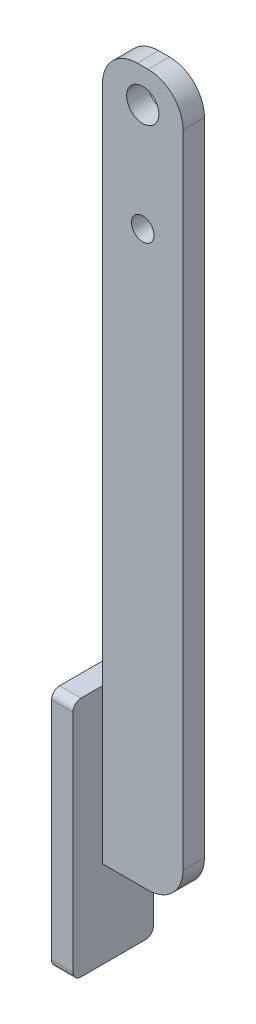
ISO-10303-21;
HEADER;
FILE_DESCRIPTION(('STEP AP214'),'2;1');
FILE_NAME('part.step','',(''),(''),'','','');
FILE_SCHEMA(('AUTOMOTIVE_DESIGN { 1 0 10303 214 1 1 1 1 }'));
ENDSEC;
DATA;
#1=APPLICATION_CONTEXT('core data for automotive mechanical design processes');
#2=APPLICATION_PROTOCOL_DEFINITION('international standard','automotive_design',2000,#1);
#3=PRODUCT_CONTEXT('',#1,'mechanical');
#4=PRODUCT('Part','Part','',(#3));
#5=PRODUCT_RELATED_PRODUCT_CATEGORY('part','',(#4));
#6=PRODUCT_DEFINITION_FORMATION('','',#4);
#7=PRODUCT_DEFINITION_CONTEXT('part definition',#1,'design');
#8=PRODUCT_DEFINITION('design','',#6,#7);
#9=PRODUCT_DEFINITION_SHAPE('','',#8);
#10=(LENGTH_UNIT() NAMED_UNIT(*) SI_UNIT(.MILLI.,.METRE.));
#11=(NAMED_UNIT(*) PLANE_ANGLE_UNIT() SI_UNIT($,.RADIAN.));
#12=(NAMED_UNIT(*) SI_UNIT($,.STERADIAN.) SOLID_ANGLE_UNIT());
#13=UNCERTAINTY_MEASURE_WITH_UNIT(LENGTH_MEASURE(1.E-05),#10,'distance_accuracy_value','');
#14=(GEOMETRIC_REPRESENTATION_CONTEXT(3) GLOBAL_UNCERTAINTY_ASSIGNED_CONTEXT((#13)) GLOBAL_UNIT_ASSIGNED_CONTEXT((#10,
#11,#12)) REPRESENTATION_CONTEXT('',''));
#15=CARTESIAN_POINT('',(0.,0.,0.));
#16=DIRECTION('',(0.,0.,1.));
#17=DIRECTION('',(1.,0.,0.));
#18=AXIS2_PLACEMENT_3D('',#15,#16,#17);
#19=CARTESIAN_POINT('',(0.,0.,4.));
#20=DIRECTION('',(0.,0.,-1.));
#21=DIRECTION('',(-1.,0.,0.));
#22=AXIS2_PLACEMENT_3D('',#19,#20,#21);
#23=PLANE('',#22);
#24=DIRECTION('',(1.,0.,0.));
#25=VECTOR('',#24,1.);
#26=CARTESIAN_POINT('',(-15.,-252.5,4.));
#27=LINE('',#26,#25);
#28=CARTESIAN_POINT('',(-15.,-252.5,4.));
#29=VERTEX_POINT('',#28);
#30=CARTESIAN_POINT('',(2.00000000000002,-252.5,4.));
#31=VERTEX_POINT('',#30);
#32=EDGE_CURVE('E218',#29,#31,#27,.T.);
#33=ORIENTED_EDGE('',*,*,#32,.T.);
#34=CARTESIAN_POINT('',(2.00000000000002,-239.5,4.));
#35=DIRECTION('',(0.,0.,-1.));
#36=DIRECTION('',(-1.,0.,0.));
#37=AXIS2_PLACEMENT_3D('',#34,#35,#36);
#38=CIRCLE('',#37,13.);
#39=CARTESIAN_POINT('',(15.,-239.5,4.));
#40=VERTEX_POINT('',#39);
#41=EDGE_CURVE('E12',#31,#40,#38,.F.);
#42=ORIENTED_EDGE('',*,*,#41,.T.);
#43=DIRECTION('',(0.,-1.,0.));
#44=VECTOR('',#43,1.);
#45=CARTESIAN_POINT('',(15.,12.5,4.));
#46=LINE('',#45,#44);
#47=CARTESIAN_POINT('',(15.,-0.499999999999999,4.));
#48=VERTEX_POINT('',#47);
#49=EDGE_CURVE('E219',#48,#40,#46,.T.);
#50=ORIENTED_EDGE('',*,*,#49,.F.);
#51=CARTESIAN_POINT('',(2.,-0.5,4.));
#52=DIRECTION('',(0.,0.,-1.));
#53=DIRECTION('',(-1.,0.,0.));
#54=AXIS2_PLACEMENT_3D('',#51,#52,#53);
#55=CIRCLE('',#54,13.);
#56=CARTESIAN_POINT('',(2.,12.5,4.));
#57=VERTEX_POINT('',#56);
#58=EDGE_CURVE('E240',#48,#57,#55,.F.);
#59=ORIENTED_EDGE('',*,*,#58,.T.);
#60=DIRECTION('',(1.,0.,0.));
#61=VECTOR('',#60,1.);
#62=CARTESIAN_POINT('',(-15.,12.5,4.));
#63=LINE('',#62,#61);
#64=CARTESIAN_POINT('',(-2.,12.5,4.));
#65=VERTEX_POINT('',#64);
#66=EDGE_CURVE('E295',#65,#57,#63,.T.);
#67=ORIENTED_EDGE('',*,*,#66,.F.);
#68=CARTESIAN_POINT('',(-2.,-0.5,4.));
#69=DIRECTION('',(0.,0.,-1.));
#70=DIRECTION('',(-1.,0.,0.));
#71=AXIS2_PLACEMENT_3D('',#68,#69,#70);
#72=CIRCLE('',#71,13.);
#73=CARTESIAN_POINT('',(-15.,-0.500000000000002,4.));
#74=VERTEX_POINT('',#73);
#75=EDGE_CURVE('E238',#65,#74,#72,.F.);
#76=ORIENTED_EDGE('',*,*,#75,.T.);
#77=DIRECTION('',(0.,-1.,0.));
#78=VECTOR('',#77,1.);
#79=CARTESIAN_POINT('',(-15.,12.5,4.));
#80=LINE('',#79,#78);
#81=CARTESIAN_POINT('',(-15.,-195.,4.));
#82=VERTEX_POINT('',#81);
#83=EDGE_CURVE('E227',#74,#82,#80,.T.);
#84=ORIENTED_EDGE('',*,*,#83,.T.);
#85=EDGE_CURVE('E294',#82,#29,#80,.T.);
#86=ORIENTED_EDGE('',*,*,#85,.T.);
#87=EDGE_LOOP('',(#33,#42,#50,#59,#67,#76,#84,#86));
#88=FACE_BOUND('',#87,.T.);
#89=CARTESIAN_POINT('',(0.,-40.,4.));
#90=DIRECTION('',(0.,0.,1.));
#91=DIRECTION('',(1.,0.,0.));
#92=AXIS2_PLACEMENT_3D('',#89,#90,#91);
#93=CIRCLE('',#92,4.2);
#94=CARTESIAN_POINT('',(4.2,-40.,4.));
#95=VERTEX_POINT('',#94);
#96=EDGE_CURVE('E290',#95,#95,#93,.T.);
#97=ORIENTED_EDGE('',*,*,#96,.F.);
#98=EDGE_LOOP('',(#97));
#99=FACE_BOUND('',#98,.T.);
#100=CARTESIAN_POINT('',(0.,0.,4.));
#101=DIRECTION('',(0.,0.,1.));
#102=DIRECTION('',(1.,0.,0.));
#103=AXIS2_PLACEMENT_3D('',#100,#101,#102);
#104=CIRCLE('',#103,6.00000000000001);
#105=CARTESIAN_POINT('',(6.00000000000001,0.,4.));
#106=VERTEX_POINT('',#105);
#107=EDGE_CURVE('E302',#106,#106,#104,.T.);
#108=ORIENTED_EDGE('',*,*,#107,.F.);
#109=EDGE_LOOP('',(#108));
#110=FACE_BOUND('',#109,.T.);
#111=ADVANCED_FACE('F69',(#88,#99,#110),#23,.F.);
#112=CARTESIAN_POINT('',(0.,0.,-4.));
#113=DIRECTION('',(0.,0.,-1.));
#114=DIRECTION('',(-1.,0.,0.));
#115=AXIS2_PLACEMENT_3D('',#112,#113,#114);
#116=PLANE('',#115);
#117=CARTESIAN_POINT('',(0.,-40.,-4.));
#118=DIRECTION('',(0.,0.,1.));
#119=DIRECTION('',(1.,0.,0.));
#120=AXIS2_PLACEMENT_3D('',#117,#118,#119);
#121=CIRCLE('',#120,4.2);
#122=CARTESIAN_POINT('',(4.2,-40.,-4.));
#123=VERTEX_POINT('',#122);
#124=EDGE_CURVE('E299',#123,#123,#121,.T.);
#125=ORIENTED_EDGE('',*,*,#124,.T.);
#126=EDGE_LOOP('',(#125));
#127=FACE_BOUND('',#126,.T.);
#128=DIRECTION('',(0.,-1.,0.));
#129=VECTOR('',#128,1.);
#130=CARTESIAN_POINT('',(15.,12.5,-4.));
#131=LINE('',#130,#129);
#132=CARTESIAN_POINT('',(15.,-0.499999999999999,-4.));
#133=VERTEX_POINT('',#132);
#134=CARTESIAN_POINT('',(15.,-239.5,-4.));
#135=VERTEX_POINT('',#134);
#136=EDGE_CURVE('E284',#133,#135,#131,.T.);
#137=ORIENTED_EDGE('',*,*,#136,.T.);
#138=CARTESIAN_POINT('',(2.00000000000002,-239.5,-4.));
#139=DIRECTION('',(0.,0.,-1.));
#140=DIRECTION('',(-1.,0.,0.));
#141=AXIS2_PLACEMENT_3D('',#138,#139,#140);
#142=CIRCLE('',#141,13.);
#143=CARTESIAN_POINT('',(2.00000000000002,-252.5,-4.));
#144=VERTEX_POINT('',#143);
#145=EDGE_CURVE('E91',#135,#144,#142,.T.);
#146=ORIENTED_EDGE('',*,*,#145,.T.);
#147=DIRECTION('',(1.,0.,0.));
#148=VECTOR('',#147,1.);
#149=CARTESIAN_POINT('',(-15.,-252.5,-4.));
#150=LINE('',#149,#148);
#151=CARTESIAN_POINT('',(-15.,-252.5,-4.));
#152=VERTEX_POINT('',#151);
#153=EDGE_CURVE('E212',#152,#144,#150,.T.);
#154=ORIENTED_EDGE('',*,*,#153,.F.);
#155=DIRECTION('',(0.,-1.,0.));
#156=VECTOR('',#155,1.);
#157=CARTESIAN_POINT('',(-15.,12.5,-4.));
#158=LINE('',#157,#156);
#159=CARTESIAN_POINT('',(-15.,-195.,-4.));
#160=VERTEX_POINT('',#159);
#161=EDGE_CURVE('E186',#160,#152,#158,.T.);
#162=ORIENTED_EDGE('',*,*,#161,.F.);
#163=CARTESIAN_POINT('',(-15.,-0.500000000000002,-4.));
#164=VERTEX_POINT('',#163);
#165=EDGE_CURVE('E211',#164,#160,#158,.T.);
#166=ORIENTED_EDGE('',*,*,#165,.F.);
#167=CARTESIAN_POINT('',(-2.,-0.5,-4.));
#168=DIRECTION('',(0.,0.,-1.));
#169=DIRECTION('',(-1.,0.,0.));
#170=AXIS2_PLACEMENT_3D('',#167,#168,#169);
#171=CIRCLE('',#170,13.);
#172=CARTESIAN_POINT('',(-2.,12.5,-4.));
#173=VERTEX_POINT('',#172);
#174=EDGE_CURVE('E232',#164,#173,#171,.T.);
#175=ORIENTED_EDGE('',*,*,#174,.T.);
#176=DIRECTION('',(1.,0.,0.));
#177=VECTOR('',#176,1.);
#178=CARTESIAN_POINT('',(-15.,12.5,-4.));
#179=LINE('',#178,#177);
#180=CARTESIAN_POINT('',(2.,12.5,-4.));
#181=VERTEX_POINT('',#180);
#182=EDGE_CURVE('E213',#173,#181,#179,.T.);
#183=ORIENTED_EDGE('',*,*,#182,.T.);
#184=CARTESIAN_POINT('',(2.,-0.5,-4.));
#185=DIRECTION('',(0.,0.,-1.));
#186=DIRECTION('',(-1.,0.,0.));
#187=AXIS2_PLACEMENT_3D('',#184,#185,#186);
#188=CIRCLE('',#187,13.);
#189=EDGE_CURVE('E234',#181,#133,#188,.T.);
#190=ORIENTED_EDGE('',*,*,#189,.T.);
#191=EDGE_LOOP('',(#137,#146,#154,#162,#166,#175,#183,#190));
#192=FACE_BOUND('',#191,.T.);
#193=CARTESIAN_POINT('',(0.,0.,-4.));
#194=DIRECTION('',(0.,0.,1.));
#195=DIRECTION('',(1.,0.,0.));
#196=AXIS2_PLACEMENT_3D('',#193,#194,#195);
#197=CIRCLE('',#196,6.00000000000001);
#198=CARTESIAN_POINT('',(6.00000000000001,0.,-4.));
#199=VERTEX_POINT('',#198);
#200=EDGE_CURVE('E305',#199,#199,#197,.T.);
#201=ORIENTED_EDGE('',*,*,#200,.T.);
#202=EDGE_LOOP('',(#201));
#203=FACE_BOUND('',#202,.T.);
#204=ADVANCED_FACE('F209',(#127,#192,#203),#116,.T.);
#205=CARTESIAN_POINT('',(-15.,-252.5,4.));
#206=DIRECTION('',(0.,1.,0.));
#207=DIRECTION('',(0.,0.,1.));
#208=AXIS2_PLACEMENT_3D('',#205,#206,#207);
#209=PLANE('',#208);
#210=ORIENTED_EDGE('',*,*,#153,.T.);
#211=DIRECTION('',(0.,0.,-1.));
#212=VECTOR('',#211,1.);
#213=CARTESIAN_POINT('',(2.00000000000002,-252.5,4.));
#214=LINE('',#213,#212);
#215=EDGE_CURVE('E77',#144,#31,#214,.F.);
#216=ORIENTED_EDGE('',*,*,#215,.T.);
#217=ORIENTED_EDGE('',*,*,#32,.F.);
#218=DIRECTION('',(0.,0.,-1.));
#219=VECTOR('',#218,1.);
#220=CARTESIAN_POINT('',(-15.,-252.5,4.));
#221=LINE('',#220,#219);
#222=EDGE_CURVE('E224',#29,#152,#221,.T.);
#223=ORIENTED_EDGE('',*,*,#222,.T.);
#224=EDGE_LOOP('',(#210,#216,#217,#223));
#225=FACE_BOUND('',#224,.T.);
#226=ADVANCED_FACE('F341',(#225),#209,.F.);
#227=CARTESIAN_POINT('',(15.,12.5,4.));
#228=DIRECTION('',(1.,0.,0.));
#229=DIRECTION('',(0.,1.,0.));
#230=AXIS2_PLACEMENT_3D('',#227,#228,#229);
#231=PLANE('',#230);
#232=ORIENTED_EDGE('',*,*,#49,.T.);
#233=DIRECTION('',(0.,0.,-1.));
#234=VECTOR('',#233,1.);
#235=CARTESIAN_POINT('',(15.,-239.5,-4.));
#236=LINE('',#235,#234);
#237=EDGE_CURVE('E276',#40,#135,#236,.T.);
#238=ORIENTED_EDGE('',*,*,#237,.T.);
#239=ORIENTED_EDGE('',*,*,#136,.F.);
#240=DIRECTION('',(0.,0.,-1.));
#241=VECTOR('',#240,1.);
#242=CARTESIAN_POINT('',(15.,-0.499999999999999,4.));
#243=LINE('',#242,#241);
#244=EDGE_CURVE('E236',#133,#48,#243,.F.);
#245=ORIENTED_EDGE('',*,*,#244,.T.);
#246=EDGE_LOOP('',(#232,#238,#239,#245));
#247=FACE_BOUND('',#246,.T.);
#248=ADVANCED_FACE('F283',(#247),#231,.T.);
#249=CARTESIAN_POINT('',(-15.,12.5,4.));
#250=DIRECTION('',(0.,1.,0.));
#251=DIRECTION('',(0.,0.,1.));
#252=AXIS2_PLACEMENT_3D('',#249,#250,#251);
#253=PLANE('',#252);
#254=ORIENTED_EDGE('',*,*,#66,.T.);
#255=DIRECTION('',(0.,0.,-1.));
#256=VECTOR('',#255,1.);
#257=CARTESIAN_POINT('',(2.,12.5,4.));
#258=LINE('',#257,#256);
#259=EDGE_CURVE('E229',#57,#181,#258,.T.);
#260=ORIENTED_EDGE('',*,*,#259,.T.);
#261=ORIENTED_EDGE('',*,*,#182,.F.);
#262=DIRECTION('',(0.,0.,-1.));
#263=VECTOR('',#262,1.);
#264=CARTESIAN_POINT('',(-2.,12.5,4.));
#265=LINE('',#264,#263);
#266=EDGE_CURVE('E226',#173,#65,#265,.F.);
#267=ORIENTED_EDGE('',*,*,#266,.T.);
#268=EDGE_LOOP('',(#254,#260,#261,#267));
#269=FACE_BOUND('',#268,.T.);
#270=ADVANCED_FACE('F349',(#269),#253,.T.);
#271=CARTESIAN_POINT('',(-15.,12.5,4.));
#272=DIRECTION('',(1.,0.,0.));
#273=DIRECTION('',(0.,1.,0.));
#274=AXIS2_PLACEMENT_3D('',#271,#272,#273);
#275=PLANE('',#274);
#276=ORIENTED_EDGE('',*,*,#165,.T.);
#277=DIRECTION('',(0.,0.,1.));
#278=VECTOR('',#277,1.);
#279=CARTESIAN_POINT('',(-15.,-195.,4.));
#280=LINE('',#279,#278);
#281=EDGE_CURVE('E196',#160,#82,#280,.T.);
#282=ORIENTED_EDGE('',*,*,#281,.T.);
#283=ORIENTED_EDGE('',*,*,#83,.F.);
#284=DIRECTION('',(0.,0.,-1.));
#285=VECTOR('',#284,1.);
#286=CARTESIAN_POINT('',(-15.,-0.500000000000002,-4.));
#287=LINE('',#286,#285);
#288=EDGE_CURVE('E206',#74,#164,#287,.T.);
#289=ORIENTED_EDGE('',*,*,#288,.T.);
#290=EDGE_LOOP('',(#276,#282,#283,#289));
#291=FACE_BOUND('',#290,.T.);
#292=ADVANCED_FACE('F216',(#291),#275,.F.);
#293=CARTESIAN_POINT('',(0.,-40.,4.));
#294=DIRECTION('',(0.,0.,-1.));
#295=DIRECTION('',(-1.,0.,0.));
#296=AXIS2_PLACEMENT_3D('',#293,#294,#295);
#297=CYLINDRICAL_SURFACE('',#296,4.2);
#298=ORIENTED_EDGE('',*,*,#96,.T.);
#299=EDGE_LOOP('',(#298));
#300=FACE_BOUND('',#299,.T.);
#301=ORIENTED_EDGE('',*,*,#124,.F.);
#302=EDGE_LOOP('',(#301));
#303=FACE_BOUND('',#302,.T.);
#304=ADVANCED_FACE('F374',(#300,#303),#297,.F.);
#305=CARTESIAN_POINT('',(0.,0.,4.));
#306=DIRECTION('',(0.,0.,-1.));
#307=DIRECTION('',(-1.,0.,0.));
#308=AXIS2_PLACEMENT_3D('',#305,#306,#307);
#309=CYLINDRICAL_SURFACE('',#308,6.00000000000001);
#310=ORIENTED_EDGE('',*,*,#107,.T.);
#311=EDGE_LOOP('',(#310));
#312=FACE_BOUND('',#311,.T.);
#313=ORIENTED_EDGE('',*,*,#200,.F.);
#314=EDGE_LOOP('',(#313));
#315=FACE_BOUND('',#314,.T.);
#316=ADVANCED_FACE('F362',(#312,#315),#309,.F.);
#317=CARTESIAN_POINT('',(2.,-0.5,4.));
#318=DIRECTION('',(0.,0.,-1.));
#319=DIRECTION('',(-1.,0.,0.));
#320=AXIS2_PLACEMENT_3D('',#317,#318,#319);
#321=CYLINDRICAL_SURFACE('',#320,13.);
#322=ORIENTED_EDGE('',*,*,#58,.F.);
#323=ORIENTED_EDGE('',*,*,#244,.F.);
#324=ORIENTED_EDGE('',*,*,#189,.F.);
#325=ORIENTED_EDGE('',*,*,#259,.F.);
#326=EDGE_LOOP('',(#322,#323,#324,#325));
#327=FACE_BOUND('',#326,.T.);
#328=ADVANCED_FACE('F346',(#327),#321,.T.);
#329=CARTESIAN_POINT('',(-2.,-0.5,4.));
#330=DIRECTION('',(0.,0.,1.));
#331=DIRECTION('',(1.,0.,0.));
#332=AXIS2_PLACEMENT_3D('',#329,#330,#331);
#333=CYLINDRICAL_SURFACE('',#332,13.);
#334=ORIENTED_EDGE('',*,*,#75,.F.);
#335=ORIENTED_EDGE('',*,*,#266,.F.);
#336=ORIENTED_EDGE('',*,*,#174,.F.);
#337=ORIENTED_EDGE('',*,*,#288,.F.);
#338=EDGE_LOOP('',(#334,#335,#336,#337));
#339=FACE_BOUND('',#338,.T.);
#340=ADVANCED_FACE('F353',(#339),#333,.T.);
#341=CARTESIAN_POINT('',(-15.,0.,0.));
#342=DIRECTION('',(1.,0.,0.));
#343=DIRECTION('',(0.,1.,0.));
#344=AXIS2_PLACEMENT_3D('',#341,#342,#343);
#345=PLANE('',#344);
#346=DIRECTION('',(0.,0.,1.));
#347=VECTOR('',#346,1.);
#348=CARTESIAN_POINT('',(-15.,-285.,-15.));
#349=LINE('',#348,#347);
#350=CARTESIAN_POINT('',(-15.,-285.,-12.));
#351=VERTEX_POINT('',#350);
#352=CARTESIAN_POINT('',(-15.,-285.,12.));
#353=VERTEX_POINT('',#352);
#354=EDGE_CURVE('E315',#351,#353,#349,.T.);
#355=ORIENTED_EDGE('',*,*,#354,.F.);
#356=CARTESIAN_POINT('',(-15.,-282.,-12.));
#357=DIRECTION('',(1.,0.,0.));
#358=DIRECTION('',(0.,1.,0.));
#359=AXIS2_PLACEMENT_3D('',#356,#357,#358);
#360=CIRCLE('',#359,3.);
#361=CARTESIAN_POINT('',(-15.,-282.,-15.));
#362=VERTEX_POINT('',#361);
#363=EDGE_CURVE('E252',#351,#362,#360,.T.);
#364=ORIENTED_EDGE('',*,*,#363,.T.);
#365=DIRECTION('',(0.,-1.,0.));
#366=VECTOR('',#365,1.);
#367=CARTESIAN_POINT('',(-15.,-195.,-15.));
#368=LINE('',#367,#366);
#369=CARTESIAN_POINT('',(-15.,-198.,-15.));
#370=VERTEX_POINT('',#369);
#371=EDGE_CURVE('E311',#370,#362,#368,.T.);
#372=ORIENTED_EDGE('',*,*,#371,.F.);
#373=CARTESIAN_POINT('',(-15.,-198.,-12.));
#374=DIRECTION('',(1.,0.,0.));
#375=DIRECTION('',(0.,1.,0.));
#376=AXIS2_PLACEMENT_3D('',#373,#374,#375);
#377=CIRCLE('',#376,3.);
#378=CARTESIAN_POINT('',(-15.,-195.,-12.));
#379=VERTEX_POINT('',#378);
#380=EDGE_CURVE('E189',#370,#379,#377,.T.);
#381=ORIENTED_EDGE('',*,*,#380,.T.);
#382=DIRECTION('',(0.,0.,1.));
#383=VECTOR('',#382,1.);
#384=CARTESIAN_POINT('',(-15.,-195.,-15.));
#385=LINE('',#384,#383);
#386=EDGE_CURVE('E181',#379,#160,#385,.T.);
#387=ORIENTED_EDGE('',*,*,#386,.T.);
#388=ORIENTED_EDGE('',*,*,#161,.T.);
#389=ORIENTED_EDGE('',*,*,#222,.F.);
#390=ORIENTED_EDGE('',*,*,#85,.F.);
#391=CARTESIAN_POINT('',(-15.,-195.,12.));
#392=VERTEX_POINT('',#391);
#393=EDGE_CURVE('E193',#82,#392,#385,.T.);
#394=ORIENTED_EDGE('',*,*,#393,.T.);
#395=CARTESIAN_POINT('',(-15.,-198.,12.));
#396=DIRECTION('',(1.,0.,0.));
#397=DIRECTION('',(0.,1.,0.));
#398=AXIS2_PLACEMENT_3D('',#395,#396,#397);
#399=CIRCLE('',#398,3.);
#400=CARTESIAN_POINT('',(-15.,-198.,15.));
#401=VERTEX_POINT('',#400);
#402=EDGE_CURVE('E247',#392,#401,#399,.T.);
#403=ORIENTED_EDGE('',*,*,#402,.T.);
#404=DIRECTION('',(0.,-1.,0.));
#405=VECTOR('',#404,1.);
#406=CARTESIAN_POINT('',(-15.,-195.,15.));
#407=LINE('',#406,#405);
#408=CARTESIAN_POINT('',(-15.,-282.,15.));
#409=VERTEX_POINT('',#408);
#410=EDGE_CURVE('E192',#401,#409,#407,.T.);
#411=ORIENTED_EDGE('',*,*,#410,.T.);
#412=CARTESIAN_POINT('',(-15.,-282.,12.));
#413=DIRECTION('',(1.,0.,0.));
#414=DIRECTION('',(0.,1.,0.));
#415=AXIS2_PLACEMENT_3D('',#412,#413,#414);
#416=CIRCLE('',#415,3.);
#417=EDGE_CURVE('E250',#409,#353,#416,.T.);
#418=ORIENTED_EDGE('',*,*,#417,.T.);
#419=EDGE_LOOP('',(#355,#364,#372,#381,#387,#388,#389,#390,#394,#403,#411,#418));
#420=FACE_BOUND('',#419,.T.);
#421=ADVANCED_FACE('F184',(#420),#345,.T.);
#422=CARTESIAN_POINT('',(-23.,-195.,-15.));
#423=DIRECTION('',(0.,1.,0.));
#424=DIRECTION('',(-1.,0.,0.));
#425=AXIS2_PLACEMENT_3D('',#422,#423,#424);
#426=PLANE('',#425);
#427=ORIENTED_EDGE('',*,*,#386,.F.);
#428=DIRECTION('',(1.,0.,0.));
#429=VECTOR('',#428,1.);
#430=CARTESIAN_POINT('',(-23.,-195.,-12.));
#431=LINE('',#430,#429);
#432=CARTESIAN_POINT('',(-23.,-195.,-12.));
#433=VERTEX_POINT('',#432);
#434=EDGE_CURVE('E274',#379,#433,#431,.F.);
#435=ORIENTED_EDGE('',*,*,#434,.T.);
#436=DIRECTION('',(0.,0.,1.));
#437=VECTOR('',#436,1.);
#438=CARTESIAN_POINT('',(-23.,-195.,-15.));
#439=LINE('',#438,#437);
#440=CARTESIAN_POINT('',(-23.,-195.,12.));
#441=VERTEX_POINT('',#440);
#442=EDGE_CURVE('E314',#433,#441,#439,.T.);
#443=ORIENTED_EDGE('',*,*,#442,.T.);
#444=DIRECTION('',(1.,0.,0.));
#445=VECTOR('',#444,1.);
#446=CARTESIAN_POINT('',(-23.,-195.,12.));
#447=LINE('',#446,#445);
#448=EDGE_CURVE('E272',#441,#392,#447,.T.);
#449=ORIENTED_EDGE('',*,*,#448,.T.);
#450=ORIENTED_EDGE('',*,*,#393,.F.);
#451=ORIENTED_EDGE('',*,*,#281,.F.);
#452=EDGE_LOOP('',(#427,#435,#443,#449,#450,#451));
#453=FACE_BOUND('',#452,.T.);
#454=ADVANCED_FACE('F197',(#453),#426,.T.);
#455=CARTESIAN_POINT('',(-23.,-195.,-15.));
#456=DIRECTION('',(0.,0.,1.));
#457=DIRECTION('',(0.,-1.,0.));
#458=AXIS2_PLACEMENT_3D('',#455,#456,#457);
#459=PLANE('',#458);
#460=ORIENTED_EDGE('',*,*,#371,.T.);
#461=DIRECTION('',(1.,0.,0.));
#462=VECTOR('',#461,1.);
#463=CARTESIAN_POINT('',(-23.,-282.,-15.));
#464=LINE('',#463,#462);
#465=CARTESIAN_POINT('',(-23.,-282.,-15.));
#466=VERTEX_POINT('',#465);
#467=EDGE_CURVE('E257',#362,#466,#464,.F.);
#468=ORIENTED_EDGE('',*,*,#467,.T.);
#469=DIRECTION('',(0.,-1.,0.));
#470=VECTOR('',#469,1.);
#471=CARTESIAN_POINT('',(-23.,-195.,-15.));
#472=LINE('',#471,#470);
#473=CARTESIAN_POINT('',(-23.,-198.,-15.));
#474=VERTEX_POINT('',#473);
#475=EDGE_CURVE('E308',#474,#466,#472,.T.);
#476=ORIENTED_EDGE('',*,*,#475,.F.);
#477=DIRECTION('',(1.,0.,0.));
#478=VECTOR('',#477,1.);
#479=CARTESIAN_POINT('',(-15.,-198.,-15.));
#480=LINE('',#479,#478);
#481=EDGE_CURVE('E254',#474,#370,#480,.T.);
#482=ORIENTED_EDGE('',*,*,#481,.T.);
#483=EDGE_LOOP('',(#460,#468,#476,#482));
#484=FACE_BOUND('',#483,.T.);
#485=ADVANCED_FACE('F486',(#484),#459,.F.);
#486=CARTESIAN_POINT('',(-23.,-285.,-15.));
#487=DIRECTION('',(0.,1.,0.));
#488=DIRECTION('',(-1.,0.,0.));
#489=AXIS2_PLACEMENT_3D('',#486,#487,#488);
#490=PLANE('',#489);
#491=DIRECTION('',(0.,0.,1.));
#492=VECTOR('',#491,1.);
#493=CARTESIAN_POINT('',(-23.,-285.,-15.));
#494=LINE('',#493,#492);
#495=CARTESIAN_POINT('',(-23.,-285.,-12.));
#496=VERTEX_POINT('',#495);
#497=CARTESIAN_POINT('',(-23.,-285.,12.));
#498=VERTEX_POINT('',#497);
#499=EDGE_CURVE('E322',#496,#498,#494,.T.);
#500=ORIENTED_EDGE('',*,*,#499,.F.);
#501=DIRECTION('',(1.,0.,0.));
#502=VECTOR('',#501,1.);
#503=CARTESIAN_POINT('',(-23.,-285.,-12.));
#504=LINE('',#503,#502);
#505=EDGE_CURVE('E244',#496,#351,#504,.T.);
#506=ORIENTED_EDGE('',*,*,#505,.T.);
#507=ORIENTED_EDGE('',*,*,#354,.T.);
#508=DIRECTION('',(1.,0.,0.));
#509=VECTOR('',#508,1.);
#510=CARTESIAN_POINT('',(-23.,-285.,12.));
#511=LINE('',#510,#509);
#512=EDGE_CURVE('E205',#353,#498,#511,.F.);
#513=ORIENTED_EDGE('',*,*,#512,.T.);
#514=EDGE_LOOP('',(#500,#506,#507,#513));
#515=FACE_BOUND('',#514,.T.);
#516=ADVANCED_FACE('F476',(#515),#490,.F.);
#517=CARTESIAN_POINT('',(-23.,-195.,15.));
#518=DIRECTION('',(0.,0.,1.));
#519=DIRECTION('',(0.,-1.,0.));
#520=AXIS2_PLACEMENT_3D('',#517,#518,#519);
#521=PLANE('',#520);
#522=DIRECTION('',(0.,-1.,0.));
#523=VECTOR('',#522,1.);
#524=CARTESIAN_POINT('',(-23.,-195.,15.));
#525=LINE('',#524,#523);
#526=CARTESIAN_POINT('',(-23.,-198.,15.));
#527=VERTEX_POINT('',#526);
#528=CARTESIAN_POINT('',(-23.,-282.,15.));
#529=VERTEX_POINT('',#528);
#530=EDGE_CURVE('E325',#527,#529,#525,.T.);
#531=ORIENTED_EDGE('',*,*,#530,.T.);
#532=DIRECTION('',(1.,0.,0.));
#533=VECTOR('',#532,1.);
#534=CARTESIAN_POINT('',(-15.,-282.,15.));
#535=LINE('',#534,#533);
#536=EDGE_CURVE('E269',#529,#409,#535,.T.);
#537=ORIENTED_EDGE('',*,*,#536,.T.);
#538=ORIENTED_EDGE('',*,*,#410,.F.);
#539=DIRECTION('',(1.,0.,0.));
#540=VECTOR('',#539,1.);
#541=CARTESIAN_POINT('',(-23.,-198.,15.));
#542=LINE('',#541,#540);
#543=EDGE_CURVE('E267',#401,#527,#542,.F.);
#544=ORIENTED_EDGE('',*,*,#543,.T.);
#545=EDGE_LOOP('',(#531,#537,#538,#544));
#546=FACE_BOUND('',#545,.T.);
#547=ADVANCED_FACE('F466',(#546),#521,.T.);
#548=CARTESIAN_POINT('',(-23.,0.,0.));
#549=DIRECTION('',(1.,0.,0.));
#550=DIRECTION('',(0.,1.,0.));
#551=AXIS2_PLACEMENT_3D('',#548,#549,#550);
#552=PLANE('',#551);
#553=CARTESIAN_POINT('',(-23.,-240.,0.));
#554=DIRECTION('',(-1.,0.,0.));
#555=DIRECTION('',(0.,-1.,0.));
#556=AXIS2_PLACEMENT_3D('',#553,#554,#555);
#557=CIRCLE('',#556,5.73609944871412);
#558=CARTESIAN_POINT('',(-23.,-245.736099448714,0.));
#559=VERTEX_POINT('',#558);
#560=EDGE_CURVE('E330',#559,#559,#557,.T.);
#561=ORIENTED_EDGE('',*,*,#560,.F.);
#562=EDGE_LOOP('',(#561));
#563=FACE_BOUND('',#562,.T.);
#564=ORIENTED_EDGE('',*,*,#475,.T.);
#565=CARTESIAN_POINT('',(-23.,-282.,-12.));
#566=DIRECTION('',(1.,0.,0.));
#567=DIRECTION('',(0.,1.,0.));
#568=AXIS2_PLACEMENT_3D('',#565,#566,#567);
#569=CIRCLE('',#568,3.);
#570=EDGE_CURVE('E265',#466,#496,#569,.F.);
#571=ORIENTED_EDGE('',*,*,#570,.T.);
#572=ORIENTED_EDGE('',*,*,#499,.T.);
#573=CARTESIAN_POINT('',(-23.,-282.,12.));
#574=DIRECTION('',(1.,0.,0.));
#575=DIRECTION('',(0.,1.,0.));
#576=AXIS2_PLACEMENT_3D('',#573,#574,#575);
#577=CIRCLE('',#576,3.);
#578=EDGE_CURVE('E263',#498,#529,#577,.F.);
#579=ORIENTED_EDGE('',*,*,#578,.T.);
#580=ORIENTED_EDGE('',*,*,#530,.F.);
#581=CARTESIAN_POINT('',(-23.,-198.,12.));
#582=DIRECTION('',(1.,0.,0.));
#583=DIRECTION('',(0.,1.,0.));
#584=AXIS2_PLACEMENT_3D('',#581,#582,#583);
#585=CIRCLE('',#584,3.);
#586=EDGE_CURVE('E259',#527,#441,#585,.F.);
#587=ORIENTED_EDGE('',*,*,#586,.T.);
#588=ORIENTED_EDGE('',*,*,#442,.F.);
#589=CARTESIAN_POINT('',(-23.,-198.,-12.));
#590=DIRECTION('',(1.,0.,0.));
#591=DIRECTION('',(0.,1.,0.));
#592=AXIS2_PLACEMENT_3D('',#589,#590,#591);
#593=CIRCLE('',#592,3.);
#594=EDGE_CURVE('E261',#433,#474,#593,.F.);
#595=ORIENTED_EDGE('',*,*,#594,.T.);
#596=EDGE_LOOP('',(#564,#571,#572,#579,#580,#587,#588,#595));
#597=FACE_BOUND('',#596,.T.);
#598=ADVANCED_FACE('F457',(#563,#597),#552,.F.);
#599=CARTESIAN_POINT('',(-22.,-240.,0.));
#600=DIRECTION('',(-1.,0.,0.));
#601=DIRECTION('',(0.,-1.,0.));
#602=AXIS2_PLACEMENT_3D('',#599,#600,#601);
#603=CYLINDRICAL_SURFACE('',#602,5.73609944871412);
#604=CARTESIAN_POINT('',(-22.,-240.,0.));
#605=DIRECTION('',(-1.,0.,0.));
#606=DIRECTION('',(0.,-1.,0.));
#607=AXIS2_PLACEMENT_3D('',#604,#605,#606);
#608=CIRCLE('',#607,5.73609944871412);
#609=CARTESIAN_POINT('',(-22.,-245.736099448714,0.));
#610=VERTEX_POINT('',#609);
#611=EDGE_CURVE('E333',#610,#610,#608,.T.);
#612=ORIENTED_EDGE('',*,*,#611,.F.);
#613=EDGE_LOOP('',(#612));
#614=FACE_BOUND('',#613,.T.);
#615=ORIENTED_EDGE('',*,*,#560,.T.);
#616=EDGE_LOOP('',(#615));
#617=FACE_BOUND('',#616,.T.);
#618=ADVANCED_FACE('F448',(#614,#617),#603,.F.);
#619=CARTESIAN_POINT('',(-22.,-240.,0.));
#620=DIRECTION('',(-1.,0.,0.));
#621=DIRECTION('',(0.,-1.,0.));
#622=AXIS2_PLACEMENT_3D('',#619,#620,#621);
#623=PLANE('',#622);
#624=ORIENTED_EDGE('',*,*,#611,.T.);
#625=EDGE_LOOP('',(#624));
#626=FACE_BOUND('',#625,.T.);
#627=ADVANCED_FACE('F438',(#626),#623,.T.);
#628=CARTESIAN_POINT('',(-23.,-282.,-12.));
#629=DIRECTION('',(1.,0.,0.));
#630=DIRECTION('',(0.,1.,0.));
#631=AXIS2_PLACEMENT_3D('',#628,#629,#630);
#632=CYLINDRICAL_SURFACE('',#631,3.);
#633=ORIENTED_EDGE('',*,*,#570,.F.);
#634=ORIENTED_EDGE('',*,*,#467,.F.);
#635=ORIENTED_EDGE('',*,*,#363,.F.);
#636=ORIENTED_EDGE('',*,*,#505,.F.);
#637=EDGE_LOOP('',(#633,#634,#635,#636));
#638=FACE_BOUND('',#637,.T.);
#639=ADVANCED_FACE('F428',(#638),#632,.T.);
#640=CARTESIAN_POINT('',(-23.,-282.,12.));
#641=DIRECTION('',(-1.,0.,0.));
#642=DIRECTION('',(0.,-1.,0.));
#643=AXIS2_PLACEMENT_3D('',#640,#641,#642);
#644=CYLINDRICAL_SURFACE('',#643,3.);
#645=ORIENTED_EDGE('',*,*,#578,.F.);
#646=ORIENTED_EDGE('',*,*,#512,.F.);
#647=ORIENTED_EDGE('',*,*,#417,.F.);
#648=ORIENTED_EDGE('',*,*,#536,.F.);
#649=EDGE_LOOP('',(#645,#646,#647,#648));
#650=FACE_BOUND('',#649,.T.);
#651=ADVANCED_FACE('F418',(#650),#644,.T.);
#652=CARTESIAN_POINT('',(-23.,-198.,-12.));
#653=DIRECTION('',(-1.,0.,0.));
#654=DIRECTION('',(0.,-1.,0.));
#655=AXIS2_PLACEMENT_3D('',#652,#653,#654);
#656=CYLINDRICAL_SURFACE('',#655,3.);
#657=ORIENTED_EDGE('',*,*,#594,.F.);
#658=ORIENTED_EDGE('',*,*,#434,.F.);
#659=ORIENTED_EDGE('',*,*,#380,.F.);
#660=ORIENTED_EDGE('',*,*,#481,.F.);
#661=EDGE_LOOP('',(#657,#658,#659,#660));
#662=FACE_BOUND('',#661,.T.);
#663=ADVANCED_FACE('F409',(#662),#656,.T.);
#664=CARTESIAN_POINT('',(-23.,-198.,12.));
#665=DIRECTION('',(1.,0.,0.));
#666=DIRECTION('',(0.,1.,0.));
#667=AXIS2_PLACEMENT_3D('',#664,#665,#666);
#668=CYLINDRICAL_SURFACE('',#667,3.);
#669=ORIENTED_EDGE('',*,*,#586,.F.);
#670=ORIENTED_EDGE('',*,*,#543,.F.);
#671=ORIENTED_EDGE('',*,*,#402,.F.);
#672=ORIENTED_EDGE('',*,*,#448,.F.);
#673=EDGE_LOOP('',(#669,#670,#671,#672));
#674=FACE_BOUND('',#673,.T.);
#675=ADVANCED_FACE('F399',(#674),#668,.T.);
#676=CARTESIAN_POINT('',(2.00000000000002,-239.5,4.));
#677=DIRECTION('',(0.,0.,1.));
#678=DIRECTION('',(1.,0.,0.));
#679=AXIS2_PLACEMENT_3D('',#676,#677,#678);
#680=CYLINDRICAL_SURFACE('',#679,13.);
#681=ORIENTED_EDGE('',*,*,#41,.F.);
#682=ORIENTED_EDGE('',*,*,#215,.F.);
#683=ORIENTED_EDGE('',*,*,#145,.F.);
#684=ORIENTED_EDGE('',*,*,#237,.F.);
#685=EDGE_LOOP('',(#681,#682,#683,#684));
#686=FACE_BOUND('',#685,.T.);
#687=ADVANCED_FACE('F71',(#686),#680,.T.);
#688=CLOSED_SHELL('',(#111,#204,#226,#248,#270,#292,#304,#316,#328,#340,#421,#454,#485,#516,
#547,#598,#618,#627,#639,#651,#663,#675,#687));
#689=MANIFOLD_SOLID_BREP('B2',#688);
#690=ADVANCED_BREP_SHAPE_REPRESENTATION('',(#18,#689),#14);
#691=SHAPE_DEFINITION_REPRESENTATION(#9,#690);
ENDSEC;
END-ISO-10303-21;
